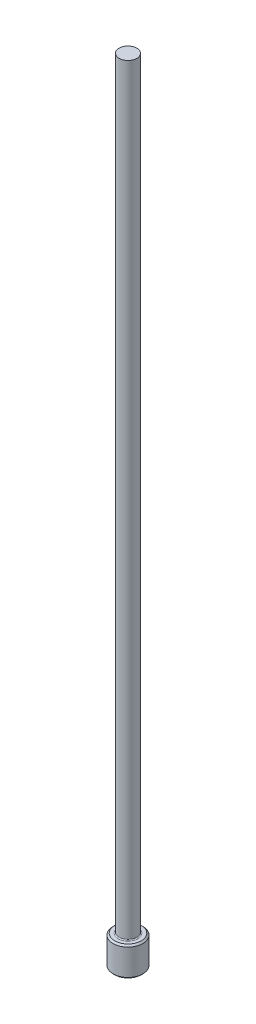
ISO-10303-21;
HEADER;
FILE_DESCRIPTION(('STEP AP214'),'2;1');
FILE_NAME('part.step','',(''),(''),'','','');
FILE_SCHEMA(('AUTOMOTIVE_DESIGN { 1 0 10303 214 1 1 1 1 }'));
ENDSEC;
DATA;
#1=APPLICATION_CONTEXT('core data for automotive mechanical design processes');
#2=APPLICATION_PROTOCOL_DEFINITION('international standard','automotive_design',2000,#1);
#3=PRODUCT_CONTEXT('',#1,'mechanical');
#4=PRODUCT('Part','Part','',(#3));
#5=PRODUCT_RELATED_PRODUCT_CATEGORY('part','',(#4));
#6=PRODUCT_DEFINITION_FORMATION('','',#4);
#7=PRODUCT_DEFINITION_CONTEXT('part definition',#1,'design');
#8=PRODUCT_DEFINITION('design','',#6,#7);
#9=PRODUCT_DEFINITION_SHAPE('','',#8);
#10=(LENGTH_UNIT() NAMED_UNIT(*) SI_UNIT(.MILLI.,.METRE.));
#11=(NAMED_UNIT(*) PLANE_ANGLE_UNIT() SI_UNIT($,.RADIAN.));
#12=(NAMED_UNIT(*) SI_UNIT($,.STERADIAN.) SOLID_ANGLE_UNIT());
#13=UNCERTAINTY_MEASURE_WITH_UNIT(LENGTH_MEASURE(1.E-05),#10,'distance_accuracy_value','');
#14=(GEOMETRIC_REPRESENTATION_CONTEXT(3) GLOBAL_UNCERTAINTY_ASSIGNED_CONTEXT((#13)) GLOBAL_UNIT_ASSIGNED_CONTEXT((#10,
#11,#12)) REPRESENTATION_CONTEXT('',''));
#15=CARTESIAN_POINT('',(0.,0.,0.));
#16=DIRECTION('',(0.,0.,1.));
#17=DIRECTION('',(1.,0.,0.));
#18=AXIS2_PLACEMENT_3D('',#15,#16,#17);
#19=CARTESIAN_POINT('',(0.,0.,0.));
#20=DIRECTION('',(0.,-1.,0.));
#21=DIRECTION('',(0.,0.,-1.));
#22=AXIS2_PLACEMENT_3D('',#19,#20,#21);
#23=PLANE('',#22);
#24=CARTESIAN_POINT('',(0.,0.,0.));
#25=DIRECTION('',(0.,-1.,0.));
#26=DIRECTION('',(0.,0.,-1.));
#27=AXIS2_PLACEMENT_3D('',#24,#25,#26);
#28=CIRCLE('',#27,1.06679999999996);
#29=CARTESIAN_POINT('',(0.,0.,-1.06679999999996));
#30=VERTEX_POINT('',#29);
#31=EDGE_CURVE('E46',#30,#30,#28,.T.);
#32=ORIENTED_EDGE('',*,*,#31,.T.);
#33=EDGE_LOOP('',(#32));
#34=FACE_BOUND('',#33,.T.);
#35=ADVANCED_FACE('F35',(#34),#23,.T.);
#36=CARTESIAN_POINT('',(0.,259.958771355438,0.));
#37=DIRECTION('',(0.,1.,0.));
#38=DIRECTION('',(0.,0.,1.));
#39=AXIS2_PLACEMENT_3D('',#36,#37,#38);
#40=CYLINDRICAL_SURFACE('',#39,1.19379999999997);
#41=CARTESIAN_POINT('',(0.,2.23519999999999,0.));
#42=DIRECTION('',(0.,1.,0.));
#43=DIRECTION('',(0.,0.,1.));
#44=AXIS2_PLACEMENT_3D('',#41,#42,#43);
#45=CIRCLE('',#44,1.19379999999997);
#46=CARTESIAN_POINT('',(0.,2.23519999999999,1.19379999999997));
#47=VERTEX_POINT('',#46);
#48=EDGE_CURVE('E50',#47,#47,#45,.F.);
#49=ORIENTED_EDGE('',*,*,#48,.T.);
#50=EDGE_LOOP('',(#49));
#51=FACE_BOUND('',#50,.T.);
#52=CARTESIAN_POINT('',(0.,0.126999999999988,0.));
#53=DIRECTION('',(0.,-1.,0.));
#54=DIRECTION('',(0.,0.,-1.));
#55=AXIS2_PLACEMENT_3D('',#52,#53,#54);
#56=CIRCLE('',#55,1.19379999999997);
#57=CARTESIAN_POINT('',(0.,0.126999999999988,-1.19379999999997));
#58=VERTEX_POINT('',#57);
#59=EDGE_CURVE('E55',#58,#58,#56,.F.);
#60=ORIENTED_EDGE('',*,*,#59,.T.);
#61=EDGE_LOOP('',(#60));
#62=FACE_BOUND('',#61,.T.);
#63=ADVANCED_FACE('F77',(#51,#62),#40,.T.);
#64=CARTESIAN_POINT('',(-1.19379999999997,2.3622,0.));
#65=DIRECTION('',(0.,1.,0.));
#66=DIRECTION('',(0.,0.,1.));
#67=AXIS2_PLACEMENT_3D('',#64,#65,#66);
#68=PLANE('',#67);
#69=CARTESIAN_POINT('',(0.,2.3622,0.));
#70=DIRECTION('',(0.,1.,0.));
#71=DIRECTION('',(0.,0.,1.));
#72=AXIS2_PLACEMENT_3D('',#69,#70,#71);
#73=CIRCLE('',#72,0.787399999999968);
#74=CARTESIAN_POINT('',(0.,2.3622,0.787399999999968));
#75=VERTEX_POINT('',#74);
#76=EDGE_CURVE('E10',#75,#75,#73,.F.);
#77=ORIENTED_EDGE('',*,*,#76,.T.);
#78=EDGE_LOOP('',(#77));
#79=FACE_BOUND('',#78,.T.);
#80=CARTESIAN_POINT('',(0.,2.3622,0.));
#81=DIRECTION('',(0.,1.,0.));
#82=DIRECTION('',(0.,0.,1.));
#83=AXIS2_PLACEMENT_3D('',#80,#81,#82);
#84=CIRCLE('',#83,1.06679999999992);
#85=CARTESIAN_POINT('',(0.,2.3622,1.06679999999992));
#86=VERTEX_POINT('',#85);
#87=EDGE_CURVE('E58',#86,#86,#84,.T.);
#88=ORIENTED_EDGE('',*,*,#87,.T.);
#89=EDGE_LOOP('',(#88));
#90=FACE_BOUND('',#89,.T.);
#91=ADVANCED_FACE('F69',(#79,#90),#68,.T.);
#92=CARTESIAN_POINT('',(0.,259.958771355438,0.));
#93=DIRECTION('',(0.,1.,0.));
#94=DIRECTION('',(0.,0.,1.));
#95=AXIS2_PLACEMENT_3D('',#92,#93,#94);
#96=CYLINDRICAL_SURFACE('',#95,0.711199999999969);
#97=CARTESIAN_POINT('',(0.,2.43840000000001,0.));
#98=DIRECTION('',(0.,1.,0.));
#99=DIRECTION('',(0.,0.,1.));
#100=AXIS2_PLACEMENT_3D('',#97,#98,#99);
#101=CIRCLE('',#100,0.711199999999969);
#102=CARTESIAN_POINT('',(0.,2.43840000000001,0.711199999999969));
#103=VERTEX_POINT('',#102);
#104=EDGE_CURVE('E42',#103,#103,#101,.T.);
#105=ORIENTED_EDGE('',*,*,#104,.T.);
#106=EDGE_LOOP('',(#105));
#107=FACE_BOUND('',#106,.T.);
#108=CARTESIAN_POINT('',(0.,63.5,0.));
#109=DIRECTION('',(0.,1.,0.));
#110=DIRECTION('',(0.,0.,1.));
#111=AXIS2_PLACEMENT_3D('',#108,#109,#110);
#112=CIRCLE('',#111,0.711199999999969);
#113=CARTESIAN_POINT('',(0.,63.5,0.711199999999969));
#114=VERTEX_POINT('',#113);
#115=EDGE_CURVE('E61',#114,#114,#112,.T.);
#116=ORIENTED_EDGE('',*,*,#115,.F.);
#117=EDGE_LOOP('',(#116));
#118=FACE_BOUND('',#117,.T.);
#119=ADVANCED_FACE('F67',(#107,#118),#96,.T.);
#120=CARTESIAN_POINT('',(-0.711199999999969,63.5,0.));
#121=DIRECTION('',(0.,1.,0.));
#122=DIRECTION('',(0.,0.,1.));
#123=AXIS2_PLACEMENT_3D('',#120,#121,#122);
#124=PLANE('',#123);
#125=ORIENTED_EDGE('',*,*,#115,.T.);
#126=EDGE_LOOP('',(#125));
#127=FACE_BOUND('',#126,.T.);
#128=ADVANCED_FACE('F65',(#127),#124,.T.);
#129=CARTESIAN_POINT('',(0.,2.36219999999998,0.));
#130=DIRECTION('',(0.,-1.,0.));
#131=DIRECTION('',(0.,0.,-1.));
#132=AXIS2_PLACEMENT_3D('',#129,#130,#131);
#133=CONICAL_SURFACE('',#132,1.06679999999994,0.785398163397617);
#134=ORIENTED_EDGE('',*,*,#48,.F.);
#135=EDGE_LOOP('',(#134));
#136=FACE_BOUND('',#135,.T.);
#137=ORIENTED_EDGE('',*,*,#87,.F.);
#138=EDGE_LOOP('',(#137));
#139=FACE_BOUND('',#138,.T.);
#140=ADVANCED_FACE('F75',(#136,#139),#133,.T.);
#141=CARTESIAN_POINT('',(0.,0.126999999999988,0.));
#142=DIRECTION('',(0.,1.,0.));
#143=DIRECTION('',(0.,0.,1.));
#144=AXIS2_PLACEMENT_3D('',#141,#142,#143);
#145=CONICAL_SURFACE('',#144,1.19379999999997,0.785398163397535);
#146=ORIENTED_EDGE('',*,*,#31,.F.);
#147=EDGE_LOOP('',(#146));
#148=FACE_BOUND('',#147,.T.);
#149=ORIENTED_EDGE('',*,*,#59,.F.);
#150=EDGE_LOOP('',(#149));
#151=FACE_BOUND('',#150,.T.);
#152=ADVANCED_FACE('F89',(#148,#151),#145,.T.);
#153=CARTESIAN_POINT('',(0.,2.43840000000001,0.));
#154=DIRECTION('',(0.,1.,0.));
#155=DIRECTION('',(0.,0.,1.));
#156=AXIS2_PLACEMENT_3D('',#153,#154,#155);
#157=TOROIDAL_SURFACE('',#156,0.787399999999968,0.0762);
#158=ORIENTED_EDGE('',*,*,#76,.F.);
#159=EDGE_LOOP('',(#158));
#160=FACE_BOUND('',#159,.T.);
#161=ORIENTED_EDGE('',*,*,#104,.F.);
#162=EDGE_LOOP('',(#161));
#163=FACE_BOUND('',#162,.T.);
#164=ADVANCED_FACE('F37',(#160,#163),#157,.F.);
#165=CLOSED_SHELL('',(#35,#63,#91,#119,#128,#140,#152,#164));
#166=MANIFOLD_SOLID_BREP('B2',#165);
#167=ADVANCED_BREP_SHAPE_REPRESENTATION('',(#18,#166),#14);
#168=SHAPE_DEFINITION_REPRESENTATION(#9,#167);
ENDSEC;
END-ISO-10303-21;
